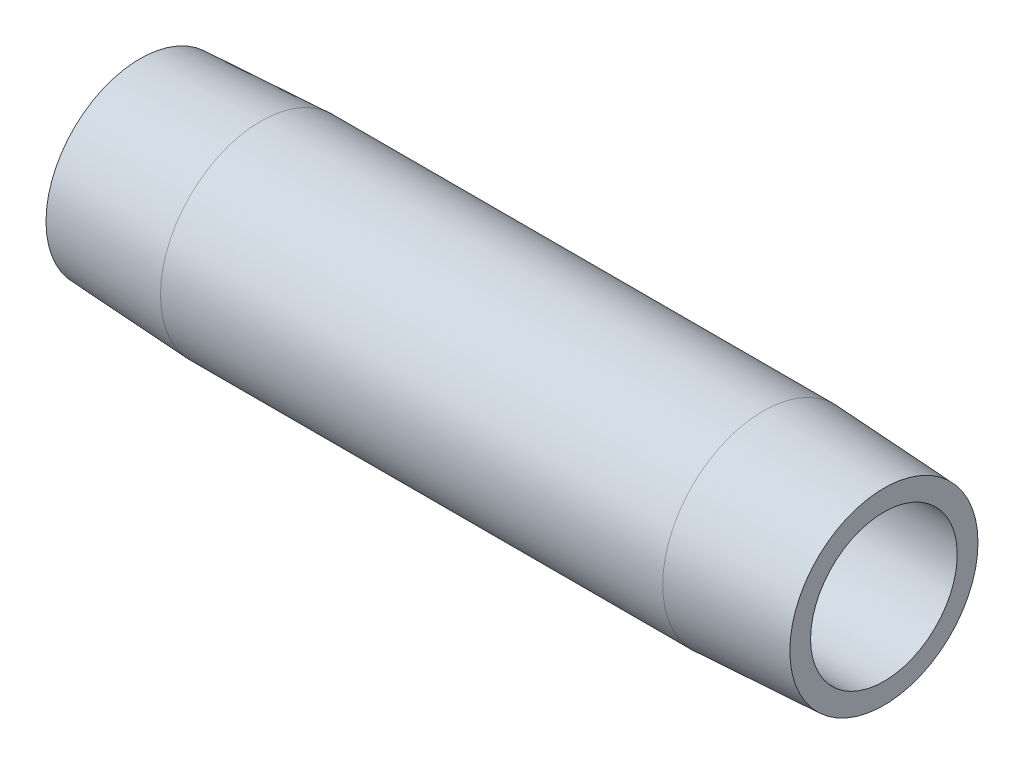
from build123d import *


with BuildPart() as part:
    # Sketch1 → Revolve1 (revolve)
    with BuildSketch(Plane.XY, mode=Mode.PRIVATE) as revolve1_sk:
        Polygon((63.5, 6.2611), (0, 6.2611), (0, 8.032050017), (10.3124, 8.5725), (53.1876, 8.5725), (63.5, 8.032050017), align=None)
    revolve(revolve1_sk.sketch.rotate(Axis((0, 0, 0), (1, 0, 0)), 90), axis=Axis((0, 0, 0), (1, 0, 0)))


solid = part.part
